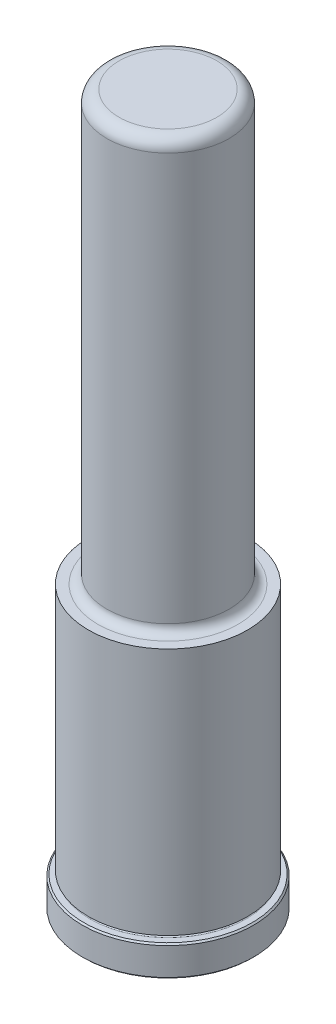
ISO-10303-21;
HEADER;
FILE_DESCRIPTION(('STEP AP214'),'2;1');
FILE_NAME('part.step','',(''),(''),'','','');
FILE_SCHEMA(('AUTOMOTIVE_DESIGN { 1 0 10303 214 1 1 1 1 }'));
ENDSEC;
DATA;
#1=APPLICATION_CONTEXT('core data for automotive mechanical design processes');
#2=APPLICATION_PROTOCOL_DEFINITION('international standard','automotive_design',2000,#1);
#3=PRODUCT_CONTEXT('',#1,'mechanical');
#4=PRODUCT('Part','Part','',(#3));
#5=PRODUCT_RELATED_PRODUCT_CATEGORY('part','',(#4));
#6=PRODUCT_DEFINITION_FORMATION('','',#4);
#7=PRODUCT_DEFINITION_CONTEXT('part definition',#1,'design');
#8=PRODUCT_DEFINITION('design','',#6,#7);
#9=PRODUCT_DEFINITION_SHAPE('','',#8);
#10=(LENGTH_UNIT() NAMED_UNIT(*) SI_UNIT(.MILLI.,.METRE.));
#11=(NAMED_UNIT(*) PLANE_ANGLE_UNIT() SI_UNIT($,.RADIAN.));
#12=(NAMED_UNIT(*) SI_UNIT($,.STERADIAN.) SOLID_ANGLE_UNIT());
#13=UNCERTAINTY_MEASURE_WITH_UNIT(LENGTH_MEASURE(1.E-05),#10,'distance_accuracy_value','');
#14=(GEOMETRIC_REPRESENTATION_CONTEXT(3) GLOBAL_UNCERTAINTY_ASSIGNED_CONTEXT((#13)) GLOBAL_UNIT_ASSIGNED_CONTEXT((#10,
#11,#12)) REPRESENTATION_CONTEXT('',''));
#15=CARTESIAN_POINT('',(0.,0.,0.));
#16=DIRECTION('',(0.,0.,1.));
#17=DIRECTION('',(1.,0.,0.));
#18=AXIS2_PLACEMENT_3D('',#15,#16,#17);
#19=CARTESIAN_POINT('',(0.,0.,0.));
#20=DIRECTION('',(0.,1.,0.));
#21=DIRECTION('',(0.,0.,1.));
#22=AXIS2_PLACEMENT_3D('',#19,#20,#21);
#23=PLANE('',#22);
#24=CARTESIAN_POINT('',(0.,0.,0.));
#25=DIRECTION('',(0.,1.,0.));
#26=DIRECTION('',(0.,0.,1.));
#27=AXIS2_PLACEMENT_3D('',#24,#25,#26);
#28=CIRCLE('',#27,21.8440000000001);
#29=CARTESIAN_POINT('',(0.,0.,21.8440000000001));
#30=VERTEX_POINT('',#29);
#31=EDGE_CURVE('E46',#30,#30,#28,.F.);
#32=ORIENTED_EDGE('',*,*,#31,.T.);
#33=EDGE_LOOP('',(#32));
#34=FACE_BOUND('',#33,.T.);
#35=ADVANCED_FACE('F31',(#34),#23,.F.);
#36=CARTESIAN_POINT('',(0.,0.,0.));
#37=DIRECTION('',(0.,1.,0.));
#38=DIRECTION('',(0.,0.,1.));
#39=AXIS2_PLACEMENT_3D('',#36,#37,#38);
#40=CYLINDRICAL_SURFACE('',#39,22.225);
#41=CARTESIAN_POINT('',(0.,0.380999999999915,0.));
#42=DIRECTION('',(0.,1.,0.));
#43=DIRECTION('',(0.,0.,1.));
#44=AXIS2_PLACEMENT_3D('',#41,#42,#43);
#45=CIRCLE('',#44,22.225);
#46=CARTESIAN_POINT('',(0.,0.380999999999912,22.225));
#47=VERTEX_POINT('',#46);
#48=EDGE_CURVE('E51',#47,#47,#45,.T.);
#49=ORIENTED_EDGE('',*,*,#48,.T.);
#50=EDGE_LOOP('',(#49));
#51=FACE_BOUND('',#50,.T.);
#52=CARTESIAN_POINT('',(0.,7.54379999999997,0.));
#53=DIRECTION('',(0.,-1.,0.));
#54=DIRECTION('',(0.,0.,-1.));
#55=AXIS2_PLACEMENT_3D('',#52,#53,#54);
#56=CIRCLE('',#55,22.225);
#57=CARTESIAN_POINT('',(0.,7.54379999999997,-22.225));
#58=VERTEX_POINT('',#57);
#59=EDGE_CURVE('E54',#58,#58,#56,.T.);
#60=ORIENTED_EDGE('',*,*,#59,.T.);
#61=EDGE_LOOP('',(#60));
#62=FACE_BOUND('',#61,.T.);
#63=ADVANCED_FACE('F110',(#51,#62),#40,.T.);
#64=CARTESIAN_POINT('',(0.,7.9248,-22.225));
#65=DIRECTION('',(0.,-1.,0.));
#66=DIRECTION('',(0.,0.,-1.));
#67=AXIS2_PLACEMENT_3D('',#64,#65,#66);
#68=PLANE('',#67);
#69=CARTESIAN_POINT('',(0.,7.9248,0.));
#70=DIRECTION('',(0.,-1.,0.));
#71=DIRECTION('',(0.,0.,-1.));
#72=AXIS2_PLACEMENT_3D('',#69,#70,#71);
#73=CIRCLE('',#72,21.844);
#74=CARTESIAN_POINT('',(0.,7.9248,-21.844));
#75=VERTEX_POINT('',#74);
#76=EDGE_CURVE('E42',#75,#75,#73,.F.);
#77=ORIENTED_EDGE('',*,*,#76,.T.);
#78=EDGE_LOOP('',(#77));
#79=FACE_BOUND('',#78,.T.);
#80=CARTESIAN_POINT('',(0.,7.9248,0.));
#81=DIRECTION('',(0.,1.,0.));
#82=DIRECTION('',(0.,0.,1.));
#83=AXIS2_PLACEMENT_3D('',#80,#81,#82);
#84=CIRCLE('',#83,20.2438);
#85=CARTESIAN_POINT('',(0.,7.92479999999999,20.2438));
#86=VERTEX_POINT('',#85);
#87=EDGE_CURVE('E57',#86,#86,#84,.T.);
#88=ORIENTED_EDGE('',*,*,#87,.F.);
#89=EDGE_LOOP('',(#88));
#90=FACE_BOUND('',#89,.T.);
#91=ADVANCED_FACE('F105',(#79,#90),#68,.F.);
#92=CARTESIAN_POINT('',(0.,8.3058,0.));
#93=DIRECTION('',(0.,1.,0.));
#94=DIRECTION('',(0.,0.,1.));
#95=AXIS2_PLACEMENT_3D('',#92,#93,#94);
#96=TOROIDAL_SURFACE('',#95,20.2438,0.380999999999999);
#97=CARTESIAN_POINT('',(0.,8.6868,0.));
#98=DIRECTION('',(0.,1.,0.));
#99=DIRECTION('',(0.,0.,1.));
#100=AXIS2_PLACEMENT_3D('',#97,#98,#99);
#101=CIRCLE('',#100,20.2438);
#102=CARTESIAN_POINT('',(0.,8.68679999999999,20.2438));
#103=VERTEX_POINT('',#102);
#104=EDGE_CURVE('E60',#103,#103,#101,.T.);
#105=ORIENTED_EDGE('',*,*,#104,.F.);
#106=EDGE_LOOP('',(#105));
#107=FACE_BOUND('',#106,.T.);
#108=ORIENTED_EDGE('',*,*,#87,.T.);
#109=EDGE_LOOP('',(#108));
#110=FACE_BOUND('',#109,.T.);
#111=ADVANCED_FACE('F99',(#107,#110),#96,.F.);
#112=CARTESIAN_POINT('',(0.,8.6868,-20.2438));
#113=DIRECTION('',(0.,1.,0.));
#114=DIRECTION('',(0.,0.,1.));
#115=AXIS2_PLACEMENT_3D('',#112,#113,#114);
#116=PLANE('',#115);
#117=CARTESIAN_POINT('',(0.,8.6868,0.));
#118=DIRECTION('',(0.,1.,0.));
#119=DIRECTION('',(0.,0.,1.));
#120=AXIS2_PLACEMENT_3D('',#117,#118,#119);
#121=CIRCLE('',#120,20.6502);
#122=CARTESIAN_POINT('',(0.,8.6868,20.6502));
#123=VERTEX_POINT('',#122);
#124=EDGE_CURVE('E63',#123,#123,#121,.T.);
#125=ORIENTED_EDGE('',*,*,#124,.F.);
#126=EDGE_LOOP('',(#125));
#127=FACE_BOUND('',#126,.T.);
#128=ORIENTED_EDGE('',*,*,#104,.T.);
#129=EDGE_LOOP('',(#128));
#130=FACE_BOUND('',#129,.T.);
#131=ADVANCED_FACE('F93',(#127,#130),#116,.F.);
#132=CARTESIAN_POINT('',(0.,0.,0.));
#133=DIRECTION('',(0.,1.,0.));
#134=DIRECTION('',(0.,0.,1.));
#135=AXIS2_PLACEMENT_3D('',#132,#133,#134);
#136=CYLINDRICAL_SURFACE('',#135,20.6502);
#137=CARTESIAN_POINT('',(0.,73.025,0.));
#138=DIRECTION('',(0.,1.,0.));
#139=DIRECTION('',(0.,0.,1.));
#140=AXIS2_PLACEMENT_3D('',#137,#138,#139);
#141=CIRCLE('',#140,20.6502);
#142=CARTESIAN_POINT('',(0.,73.025,20.6502));
#143=VERTEX_POINT('',#142);
#144=EDGE_CURVE('E66',#143,#143,#141,.T.);
#145=ORIENTED_EDGE('',*,*,#144,.F.);
#146=EDGE_LOOP('',(#145));
#147=FACE_BOUND('',#146,.T.);
#148=ORIENTED_EDGE('',*,*,#124,.T.);
#149=EDGE_LOOP('',(#148));
#150=FACE_BOUND('',#149,.T.);
#151=ADVANCED_FACE('F87',(#147,#150),#136,.T.);
#152=CARTESIAN_POINT('',(0.,73.025,-20.6502));
#153=DIRECTION('',(0.,-1.,0.));
#154=DIRECTION('',(0.,0.,-1.));
#155=AXIS2_PLACEMENT_3D('',#152,#153,#154);
#156=PLANE('',#155);
#157=CARTESIAN_POINT('',(0.,73.025,0.));
#158=DIRECTION('',(0.,1.,0.));
#159=DIRECTION('',(0.,0.,1.));
#160=AXIS2_PLACEMENT_3D('',#157,#158,#159);
#161=CIRCLE('',#160,18.1483);
#162=CARTESIAN_POINT('',(0.,73.025,18.1483));
#163=VERTEX_POINT('',#162);
#164=EDGE_CURVE('E69',#163,#163,#161,.T.);
#165=ORIENTED_EDGE('',*,*,#164,.F.);
#166=EDGE_LOOP('',(#165));
#167=FACE_BOUND('',#166,.T.);
#168=ORIENTED_EDGE('',*,*,#144,.T.);
#169=EDGE_LOOP('',(#168));
#170=FACE_BOUND('',#169,.T.);
#171=ADVANCED_FACE('F81',(#167,#170),#156,.F.);
#172=CARTESIAN_POINT('',(0.,75.311,0.));
#173=DIRECTION('',(0.,1.,0.));
#174=DIRECTION('',(0.,0.,1.));
#175=AXIS2_PLACEMENT_3D('',#172,#173,#174);
#176=TOROIDAL_SURFACE('',#175,18.1483,2.286);
#177=CARTESIAN_POINT('',(0.,75.311,0.));
#178=DIRECTION('',(0.,1.,0.));
#179=DIRECTION('',(0.,0.,1.));
#180=AXIS2_PLACEMENT_3D('',#177,#178,#179);
#181=CIRCLE('',#180,15.8623);
#182=CARTESIAN_POINT('',(0.,75.311,15.8623));
#183=VERTEX_POINT('',#182);
#184=EDGE_CURVE('E72',#183,#183,#181,.T.);
#185=ORIENTED_EDGE('',*,*,#184,.F.);
#186=EDGE_LOOP('',(#185));
#187=FACE_BOUND('',#186,.T.);
#188=ORIENTED_EDGE('',*,*,#164,.T.);
#189=EDGE_LOOP('',(#188));
#190=FACE_BOUND('',#189,.T.);
#191=ADVANCED_FACE('F78',(#187,#190),#176,.F.);
#192=CARTESIAN_POINT('',(0.,0.,0.));
#193=DIRECTION('',(0.,1.,0.));
#194=DIRECTION('',(0.,0.,1.));
#195=AXIS2_PLACEMENT_3D('',#192,#193,#194);
#196=CYLINDRICAL_SURFACE('',#195,15.8623);
#197=CARTESIAN_POINT('',(0.,180.975,0.));
#198=DIRECTION('',(0.,-1.,0.));
#199=DIRECTION('',(0.,0.,-1.));
#200=AXIS2_PLACEMENT_3D('',#197,#198,#199);
#201=CIRCLE('',#200,15.8623);
#202=CARTESIAN_POINT('',(0.,180.975,-15.8623));
#203=VERTEX_POINT('',#202);
#204=EDGE_CURVE('E10',#203,#203,#201,.T.);
#205=ORIENTED_EDGE('',*,*,#204,.T.);
#206=EDGE_LOOP('',(#205));
#207=FACE_BOUND('',#206,.T.);
#208=ORIENTED_EDGE('',*,*,#184,.T.);
#209=EDGE_LOOP('',(#208));
#210=FACE_BOUND('',#209,.T.);
#211=ADVANCED_FACE('F76',(#207,#210),#196,.T.);
#212=CARTESIAN_POINT('',(0.,184.15,-15.8623));
#213=DIRECTION('',(0.,-1.,0.));
#214=DIRECTION('',(0.,0.,-1.));
#215=AXIS2_PLACEMENT_3D('',#212,#213,#214);
#216=PLANE('',#215);
#217=CARTESIAN_POINT('',(0.,184.15,0.));
#218=DIRECTION('',(0.,-1.,0.));
#219=DIRECTION('',(0.,0.,-1.));
#220=AXIS2_PLACEMENT_3D('',#217,#218,#219);
#221=CIRCLE('',#220,12.6873);
#222=CARTESIAN_POINT('',(0.,184.15,-12.6873));
#223=VERTEX_POINT('',#222);
#224=EDGE_CURVE('E38',#223,#223,#221,.F.);
#225=ORIENTED_EDGE('',*,*,#224,.T.);
#226=EDGE_LOOP('',(#225));
#227=FACE_BOUND('',#226,.T.);
#228=ADVANCED_FACE('F127',(#227),#216,.F.);
#229=CARTESIAN_POINT('',(0.,0.380999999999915,0.));
#230=DIRECTION('',(0.,1.,0.));
#231=DIRECTION('',(0.,0.,1.));
#232=AXIS2_PLACEMENT_3D('',#229,#230,#231);
#233=CONICAL_SURFACE('',#232,22.225,0.785398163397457);
#234=ORIENTED_EDGE('',*,*,#31,.F.);
#235=EDGE_LOOP('',(#234));
#236=FACE_BOUND('',#235,.T.);
#237=ORIENTED_EDGE('',*,*,#48,.F.);
#238=EDGE_LOOP('',(#237));
#239=FACE_BOUND('',#238,.T.);
#240=ADVANCED_FACE('F124',(#236,#239),#233,.T.);
#241=CARTESIAN_POINT('',(0.,7.9248,0.));
#242=DIRECTION('',(0.,-1.,0.));
#243=DIRECTION('',(0.,0.,-1.));
#244=AXIS2_PLACEMENT_3D('',#241,#242,#243);
#245=CONICAL_SURFACE('',#244,21.844,0.785398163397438);
#246=CARTESIAN_POINT('',(0.,7.54379999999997,-22.225));
#247=CARTESIAN_POINT('',(0.,7.54776874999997,-22.22103125));
#248=CARTESIAN_POINT('',(0.,7.55173749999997,-22.2170625));
#249=CARTESIAN_POINT('',(0.,7.55967499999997,-22.209125));
#250=CARTESIAN_POINT('',(0.,7.56364374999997,-22.20515625));
#251=CARTESIAN_POINT('',(0.,7.57158124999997,-22.19721875));
#252=CARTESIAN_POINT('',(0.,7.57554999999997,-22.19325));
#253=CARTESIAN_POINT('',(0.,7.58348749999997,-22.1853125));
#254=CARTESIAN_POINT('',(0.,7.58745624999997,-22.18134375));
#255=CARTESIAN_POINT('',(0.,7.59539374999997,-22.17340625));
#256=CARTESIAN_POINT('',(0.,7.59936249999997,-22.1694375));
#257=CARTESIAN_POINT('',(0.,7.60729999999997,-22.1615));
#258=CARTESIAN_POINT('',(0.,7.61126874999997,-22.15753125));
#259=CARTESIAN_POINT('',(0.,7.61920624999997,-22.14959375));
#260=CARTESIAN_POINT('',(0.,7.62317499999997,-22.145625));
#261=CARTESIAN_POINT('',(0.,7.63111249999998,-22.1376875));
#262=CARTESIAN_POINT('',(0.,7.63508124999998,-22.13371875));
#263=CARTESIAN_POINT('',(0.,7.64301874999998,-22.12578125));
#264=CARTESIAN_POINT('',(0.,7.64698749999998,-22.1218125));
#265=CARTESIAN_POINT('',(0.,7.65492499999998,-22.113875));
#266=CARTESIAN_POINT('',(0.,7.65889374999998,-22.10990625));
#267=CARTESIAN_POINT('',(0.,7.66683124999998,-22.10196875));
#268=CARTESIAN_POINT('',(0.,7.67079999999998,-22.098));
#269=CARTESIAN_POINT('',(0.,7.67873749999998,-22.0900625));
#270=CARTESIAN_POINT('',(0.,7.68270624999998,-22.08609375));
#271=CARTESIAN_POINT('',(0.,7.69064374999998,-22.07815625));
#272=CARTESIAN_POINT('',(0.,7.69461249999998,-22.0741875));
#273=CARTESIAN_POINT('',(0.,7.70254999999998,-22.06625));
#274=CARTESIAN_POINT('',(0.,7.70651874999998,-22.06228125));
#275=CARTESIAN_POINT('',(0.,7.71445624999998,-22.05434375));
#276=CARTESIAN_POINT('',(0.,7.71842499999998,-22.050375));
#277=CARTESIAN_POINT('',(0.,7.72636249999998,-22.0424375));
#278=CARTESIAN_POINT('',(0.,7.73033124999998,-22.03846875));
#279=CARTESIAN_POINT('',(0.,7.73826874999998,-22.03053125));
#280=CARTESIAN_POINT('',(0.,7.74223749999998,-22.0265625));
#281=CARTESIAN_POINT('',(0.,7.75017499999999,-22.018625));
#282=CARTESIAN_POINT('',(0.,7.75414374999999,-22.01465625));
#283=CARTESIAN_POINT('',(0.,7.76208124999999,-22.00671875));
#284=CARTESIAN_POINT('',(0.,7.76604999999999,-22.00275));
#285=CARTESIAN_POINT('',(0.,7.77398749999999,-21.9948125));
#286=CARTESIAN_POINT('',(0.,7.77795624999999,-21.99084375));
#287=CARTESIAN_POINT('',(0.,7.78589374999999,-21.98290625));
#288=CARTESIAN_POINT('',(0.,7.78986249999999,-21.9789375));
#289=CARTESIAN_POINT('',(0.,7.79779999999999,-21.971));
#290=CARTESIAN_POINT('',(0.,7.80176874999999,-21.96703125));
#291=CARTESIAN_POINT('',(0.,7.80970624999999,-21.95909375));
#292=CARTESIAN_POINT('',(0.,7.81367499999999,-21.955125));
#293=CARTESIAN_POINT('',(0.,7.82161249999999,-21.9471875));
#294=CARTESIAN_POINT('',(0.,7.82558124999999,-21.94321875));
#295=CARTESIAN_POINT('',(0.,7.83351874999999,-21.93528125));
#296=CARTESIAN_POINT('',(0.,7.83748749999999,-21.9313125));
#297=CARTESIAN_POINT('',(0.,7.84542499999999,-21.923375));
#298=CARTESIAN_POINT('',(0.,7.84939374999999,-21.91940625));
#299=CARTESIAN_POINT('',(0.,7.85733124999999,-21.91146875));
#300=CARTESIAN_POINT('',(0.,7.86129999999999,-21.9075));
#301=CARTESIAN_POINT('',(0.,7.8692375,-21.8995625));
#302=CARTESIAN_POINT('',(0.,7.87320625,-21.89559375));
#303=CARTESIAN_POINT('',(0.,7.88114375,-21.88765625));
#304=CARTESIAN_POINT('',(0.,7.8851125,-21.8836875));
#305=CARTESIAN_POINT('',(0.,7.89305,-21.87575));
#306=CARTESIAN_POINT('',(0.,7.89701875,-21.87178125));
#307=CARTESIAN_POINT('',(0.,7.90495625,-21.86384375));
#308=CARTESIAN_POINT('',(0.,7.908925,-21.859875));
#309=CARTESIAN_POINT('',(0.,7.9168625,-21.8519375));
#310=CARTESIAN_POINT('',(0.,7.92083125,-21.84796875));
#311=CARTESIAN_POINT('',(0.,7.9248,-21.844));
#312=B_SPLINE_CURVE_WITH_KNOTS('',3,(#246,#247,#248,#249,#250,#251,#252,#253,#254,#255,#256,
#257,#258,#259,#260,#261,#262,#263,#264,#265,#266,#267,#268,#269,#270,#271,#272,#273,#274,#275,
#276,#277,#278,#279,#280,#281,#282,#283,#284,#285,#286,#287,#288,#289,#290,#291,#292,#293,#294,
#295,#296,#297,#298,#299,#300,#301,#302,#303,#304,#305,#306,#307,#308,#309,#310,#311),
.UNSPECIFIED.,.F.,.F.,(4,2,2,2,2,2,2,2,2,2,2,2,2,2,2,2,2,2,2,2,2,2,2,2,2,2,2,2,2,2,2,2,4),(0.,
0.0168379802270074,0.0336759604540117,0.0505139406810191,0.0673519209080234,0.0841899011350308,
0.101027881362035,0.117865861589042,0.134703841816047,0.151541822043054,0.168379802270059,
0.185217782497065,0.202055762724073,0.218893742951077,0.235731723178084,0.252569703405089,
0.269407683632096,0.286245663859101,0.303083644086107,0.319921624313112,0.336759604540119,
0.353597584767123,0.370435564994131,0.387273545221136,0.404111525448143,0.420949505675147,
0.437787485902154,0.45462546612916,0.471463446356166,0.488301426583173,0.505139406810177,
0.521977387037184,0.538815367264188),.UNSPECIFIED.);
#313=EDGE_CURVE('BSEAM126',#58,#75,#312,.T.);
#314=ORIENTED_EDGE('',*,*,#59,.F.);
#315=ORIENTED_EDGE('',*,*,#76,.F.);
#316=ORIENTED_EDGE('',*,*,#313,.T.);
#317=ORIENTED_EDGE('',*,*,#313,.F.);
#318=EDGE_LOOP('',(#314,#316,#315,#317));
#319=FACE_BOUND('',#318,.T.);
#320=ADVANCED_FACE('F126',(#319),#245,.T.);
#321=CARTESIAN_POINT('',(0.,180.975,0.));
#322=DIRECTION('',(0.,-1.,0.));
#323=DIRECTION('',(0.,0.,-1.));
#324=AXIS2_PLACEMENT_3D('',#321,#322,#323);
#325=TOROIDAL_SURFACE('',#324,12.6873,3.175);
#326=ORIENTED_EDGE('',*,*,#204,.F.);
#327=EDGE_LOOP('',(#326));
#328=FACE_BOUND('',#327,.T.);
#329=ORIENTED_EDGE('',*,*,#224,.F.);
#330=EDGE_LOOP('',(#329));
#331=FACE_BOUND('',#330,.T.);
#332=ADVANCED_FACE('F33',(#328,#331),#325,.T.);
#333=CLOSED_SHELL('',(#35,#63,#91,#111,#131,#151,#171,#191,#211,#228,#240,#320,#332));
#334=MANIFOLD_SOLID_BREP('B2',#333);
#335=ADVANCED_BREP_SHAPE_REPRESENTATION('',(#18,#334),#14);
#336=SHAPE_DEFINITION_REPRESENTATION(#9,#335);
ENDSEC;
END-ISO-10303-21;
